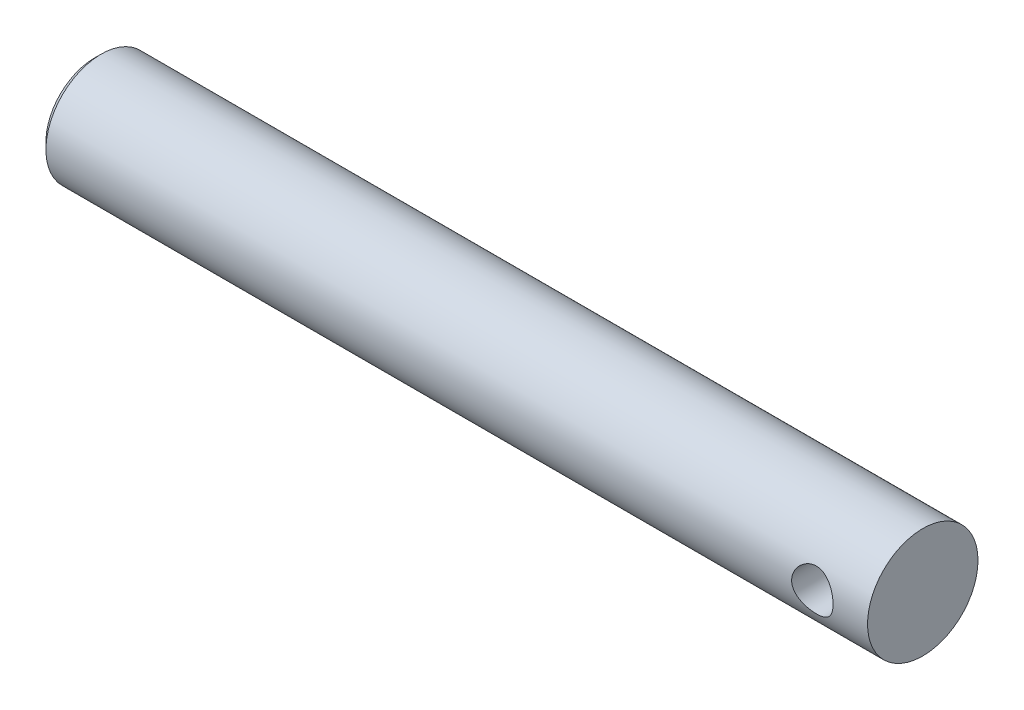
from build123d import *

# Parameters (mm, degrees)
SKETCH1_R               = 6.35
BASE_EXTRUDE_DEPTH      = 95.25
CUT_EXTRUDE1_DEPTH      = 96.672396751
CUT_EXTRUDE1_DEPTH_BACK = 96.672396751
SKETCH2_R               = 2.38125
SKETCH3_R               = 2.38125
CUT_EXTRUDE2_DEPTH      = 25.4
CHAMFER2_SIZE           = 0.762


with BuildPart() as part:
    # Sketch1 → Base-Extrude (new body)
    with BuildSketch(Plane(origin=(0, 0, 0), x_dir=(0, 0, -1), z_dir=(1, 0, 0))):
        Circle(SKETCH1_R)
    extrude(amount=BASE_EXTRUDE_DEPTH)

    # Sketch2 → Cut-Extrude1 (cut, two sides: drawn at the far end of the back side and taken through both)
    with BuildSketch(Plane.XY.offset(-CUT_EXTRUDE1_DEPTH_BACK)):
        with Locations((88.9, 0)):
            Circle(SKETCH2_R)
    extrude(amount=CUT_EXTRUDE1_DEPTH + CUT_EXTRUDE1_DEPTH_BACK, mode=Mode.SUBTRACT)

    # Sketch3 → Cut-Extrude2 (cut)
    with BuildSketch(Plane.ZY):
        Circle(SKETCH3_R)
    extrude(amount=-CUT_EXTRUDE2_DEPTH, mode=Mode.SUBTRACT)

    # Chamfer2
    chamfer2_edges = [part.edges().sort_by_distance(p)[0] for p in [
        (0, 0, 6.35),
    ]]
    chamfer(chamfer2_edges, length=CHAMFER2_SIZE)


solid = part.part
